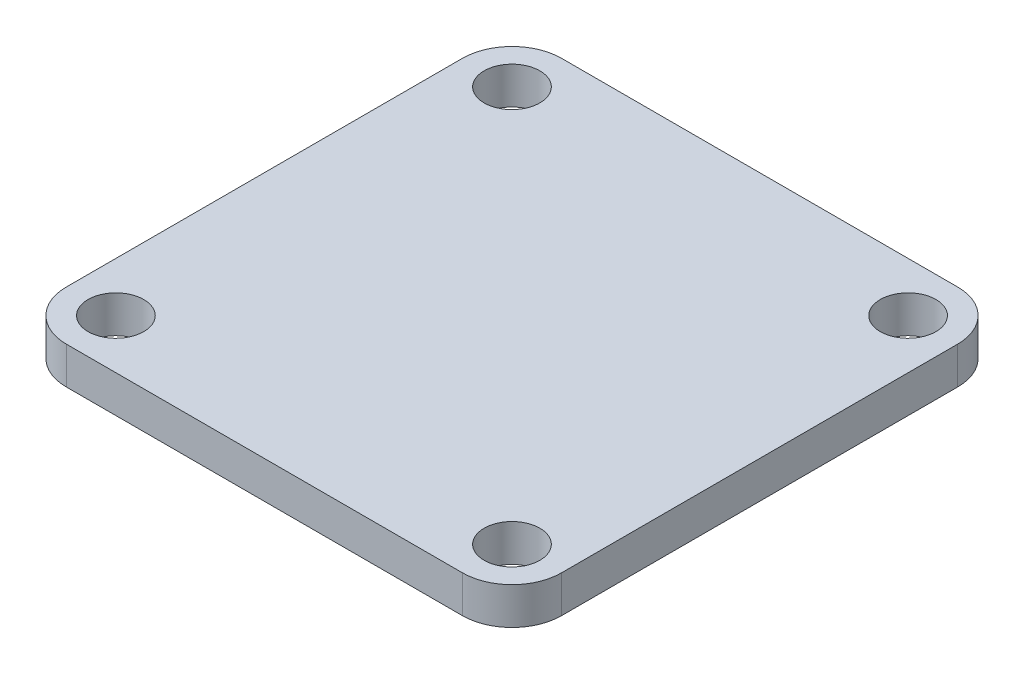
ISO-10303-21;
HEADER;
FILE_DESCRIPTION(('STEP AP214'),'2;1');
FILE_NAME('part.step','',(''),(''),'','','');
FILE_SCHEMA(('AUTOMOTIVE_DESIGN { 1 0 10303 214 1 1 1 1 }'));
ENDSEC;
DATA;
#1=APPLICATION_CONTEXT('core data for automotive mechanical design processes');
#2=APPLICATION_PROTOCOL_DEFINITION('international standard','automotive_design',2000,#1);
#3=PRODUCT_CONTEXT('',#1,'mechanical');
#4=PRODUCT('Part','Part','',(#3));
#5=PRODUCT_RELATED_PRODUCT_CATEGORY('part','',(#4));
#6=PRODUCT_DEFINITION_FORMATION('','',#4);
#7=PRODUCT_DEFINITION_CONTEXT('part definition',#1,'design');
#8=PRODUCT_DEFINITION('design','',#6,#7);
#9=PRODUCT_DEFINITION_SHAPE('','',#8);
#10=(LENGTH_UNIT() NAMED_UNIT(*) SI_UNIT(.MILLI.,.METRE.));
#11=(NAMED_UNIT(*) PLANE_ANGLE_UNIT() SI_UNIT($,.RADIAN.));
#12=(NAMED_UNIT(*) SI_UNIT($,.STERADIAN.) SOLID_ANGLE_UNIT());
#13=UNCERTAINTY_MEASURE_WITH_UNIT(LENGTH_MEASURE(1.E-05),#10,'distance_accuracy_value','');
#14=(GEOMETRIC_REPRESENTATION_CONTEXT(3) GLOBAL_UNCERTAINTY_ASSIGNED_CONTEXT((#13)) GLOBAL_UNIT_ASSIGNED_CONTEXT((#10,
#11,#12)) REPRESENTATION_CONTEXT('',''));
#15=CARTESIAN_POINT('',(0.,0.,0.));
#16=DIRECTION('',(0.,0.,1.));
#17=DIRECTION('',(1.,0.,0.));
#18=AXIS2_PLACEMENT_3D('',#15,#16,#17);
#19=CARTESIAN_POINT('',(-16.,3.,16.));
#20=DIRECTION('',(0.,1.,0.));
#21=DIRECTION('',(0.,0.,1.));
#22=AXIS2_PLACEMENT_3D('',#19,#20,#21);
#23=PLANE('',#22);
#24=CARTESIAN_POINT('',(-16.,3.,16.));
#25=DIRECTION('',(0.,1.,0.));
#26=DIRECTION('',(0.,0.,1.));
#27=AXIS2_PLACEMENT_3D('',#24,#25,#26);
#28=CIRCLE('',#27,2.25);
#29=CARTESIAN_POINT('',(-16.,3.,18.25));
#30=VERTEX_POINT('',#29);
#31=EDGE_CURVE('E222',#30,#30,#28,.T.);
#32=ORIENTED_EDGE('',*,*,#31,.F.);
#33=EDGE_LOOP('',(#32));
#34=FACE_BOUND('',#33,.T.);
#35=CARTESIAN_POINT('',(-16.,3.,-16.));
#36=DIRECTION('',(0.,1.,0.));
#37=DIRECTION('',(0.,0.,1.));
#38=AXIS2_PLACEMENT_3D('',#35,#36,#37);
#39=CIRCLE('',#38,2.25);
#40=CARTESIAN_POINT('',(-16.,3.,-13.75));
#41=VERTEX_POINT('',#40);
#42=EDGE_CURVE('E147',#41,#41,#39,.T.);
#43=ORIENTED_EDGE('',*,*,#42,.F.);
#44=EDGE_LOOP('',(#43));
#45=FACE_BOUND('',#44,.T.);
#46=CARTESIAN_POINT('',(-16.,3.,16.));
#47=DIRECTION('',(0.,1.,0.));
#48=DIRECTION('',(0.,0.,1.));
#49=AXIS2_PLACEMENT_3D('',#46,#47,#48);
#50=CIRCLE('',#49,4.);
#51=CARTESIAN_POINT('',(-20.,3.,16.));
#52=VERTEX_POINT('',#51);
#53=CARTESIAN_POINT('',(-16.,3.,20.));
#54=VERTEX_POINT('',#53);
#55=EDGE_CURVE('E164',#52,#54,#50,.T.);
#56=ORIENTED_EDGE('',*,*,#55,.T.);
#57=DIRECTION('',(1.,0.,0.));
#58=VECTOR('',#57,1.);
#59=CARTESIAN_POINT('',(-16.,3.,20.));
#60=LINE('',#59,#58);
#61=CARTESIAN_POINT('',(16.,3.,20.));
#62=VERTEX_POINT('',#61);
#63=EDGE_CURVE('E100',#54,#62,#60,.T.);
#64=ORIENTED_EDGE('',*,*,#63,.T.);
#65=CARTESIAN_POINT('',(16.,3.,16.));
#66=DIRECTION('',(0.,1.,0.));
#67=DIRECTION('',(0.,0.,1.));
#68=AXIS2_PLACEMENT_3D('',#65,#66,#67);
#69=CIRCLE('',#68,4.);
#70=CARTESIAN_POINT('',(20.,3.,16.));
#71=VERTEX_POINT('',#70);
#72=EDGE_CURVE('E185',#62,#71,#69,.T.);
#73=ORIENTED_EDGE('',*,*,#72,.T.);
#74=DIRECTION('',(0.,0.,-1.));
#75=VECTOR('',#74,1.);
#76=CARTESIAN_POINT('',(20.,3.,-16.));
#77=LINE('',#76,#75);
#78=CARTESIAN_POINT('',(20.,3.,-16.));
#79=VERTEX_POINT('',#78);
#80=EDGE_CURVE('E199',#71,#79,#77,.T.);
#81=ORIENTED_EDGE('',*,*,#80,.T.);
#82=CARTESIAN_POINT('',(16.,3.,-16.));
#83=DIRECTION('',(0.,1.,0.));
#84=DIRECTION('',(0.,0.,1.));
#85=AXIS2_PLACEMENT_3D('',#82,#83,#84);
#86=CIRCLE('',#85,4.);
#87=CARTESIAN_POINT('',(16.,3.,-20.));
#88=VERTEX_POINT('',#87);
#89=EDGE_CURVE('E119',#79,#88,#86,.T.);
#90=ORIENTED_EDGE('',*,*,#89,.T.);
#91=DIRECTION('',(-1.,0.,0.));
#92=VECTOR('',#91,1.);
#93=CARTESIAN_POINT('',(-16.,3.,-20.));
#94=LINE('',#93,#92);
#95=CARTESIAN_POINT('',(-16.,3.,-20.));
#96=VERTEX_POINT('',#95);
#97=EDGE_CURVE('E113',#88,#96,#94,.T.);
#98=ORIENTED_EDGE('',*,*,#97,.T.);
#99=CARTESIAN_POINT('',(-16.,3.,-16.));
#100=DIRECTION('',(0.,1.,0.));
#101=DIRECTION('',(0.,0.,1.));
#102=AXIS2_PLACEMENT_3D('',#99,#100,#101);
#103=CIRCLE('',#102,4.);
#104=CARTESIAN_POINT('',(-20.,3.,-16.));
#105=VERTEX_POINT('',#104);
#106=EDGE_CURVE('E117',#96,#105,#103,.T.);
#107=ORIENTED_EDGE('',*,*,#106,.T.);
#108=DIRECTION('',(0.,0.,1.));
#109=VECTOR('',#108,1.);
#110=CARTESIAN_POINT('',(-20.,3.,-16.));
#111=LINE('',#110,#109);
#112=EDGE_CURVE('E57',#105,#52,#111,.T.);
#113=ORIENTED_EDGE('',*,*,#112,.T.);
#114=EDGE_LOOP('',(#56,#64,#73,#81,#90,#98,#107,#113));
#115=FACE_BOUND('',#114,.T.);
#116=CARTESIAN_POINT('',(16.,3.,-16.));
#117=DIRECTION('',(0.,1.,0.));
#118=DIRECTION('',(0.,0.,1.));
#119=AXIS2_PLACEMENT_3D('',#116,#117,#118);
#120=CIRCLE('',#119,2.25);
#121=CARTESIAN_POINT('',(16.,3.,-13.75));
#122=VERTEX_POINT('',#121);
#123=EDGE_CURVE('E214',#122,#122,#120,.T.);
#124=ORIENTED_EDGE('',*,*,#123,.F.);
#125=EDGE_LOOP('',(#124));
#126=FACE_BOUND('',#125,.T.);
#127=CARTESIAN_POINT('',(16.,3.,16.));
#128=DIRECTION('',(0.,1.,0.));
#129=DIRECTION('',(0.,0.,1.));
#130=AXIS2_PLACEMENT_3D('',#127,#128,#129);
#131=CIRCLE('',#130,2.25);
#132=CARTESIAN_POINT('',(16.,3.,18.25));
#133=VERTEX_POINT('',#132);
#134=EDGE_CURVE('E229',#133,#133,#131,.T.);
#135=ORIENTED_EDGE('',*,*,#134,.F.);
#136=EDGE_LOOP('',(#135));
#137=FACE_BOUND('',#136,.T.);
#138=ADVANCED_FACE('F39',(#34,#45,#115,#126,#137),#23,.T.);
#139=CARTESIAN_POINT('',(-16.,0.,16.));
#140=DIRECTION('',(0.,1.,0.));
#141=DIRECTION('',(0.,0.,1.));
#142=AXIS2_PLACEMENT_3D('',#139,#140,#141);
#143=PLANE('',#142);
#144=CARTESIAN_POINT('',(-16.,0.,16.));
#145=DIRECTION('',(0.,1.,0.));
#146=DIRECTION('',(0.,0.,1.));
#147=AXIS2_PLACEMENT_3D('',#144,#145,#146);
#148=CIRCLE('',#147,4.);
#149=CARTESIAN_POINT('',(-20.,0.,16.));
#150=VERTEX_POINT('',#149);
#151=CARTESIAN_POINT('',(-16.,0.,20.));
#152=VERTEX_POINT('',#151);
#153=EDGE_CURVE('E142',#150,#152,#148,.T.);
#154=ORIENTED_EDGE('',*,*,#153,.F.);
#155=DIRECTION('',(0.,0.,1.));
#156=VECTOR('',#155,1.);
#157=CARTESIAN_POINT('',(-20.,0.,-16.));
#158=LINE('',#157,#156);
#159=CARTESIAN_POINT('',(-20.,0.,-16.));
#160=VERTEX_POINT('',#159);
#161=EDGE_CURVE('E92',#160,#150,#158,.T.);
#162=ORIENTED_EDGE('',*,*,#161,.F.);
#163=CARTESIAN_POINT('',(-16.,0.,-16.));
#164=DIRECTION('',(0.,1.,0.));
#165=DIRECTION('',(0.,0.,1.));
#166=AXIS2_PLACEMENT_3D('',#163,#164,#165);
#167=CIRCLE('',#166,4.);
#168=CARTESIAN_POINT('',(-16.,0.,-20.));
#169=VERTEX_POINT('',#168);
#170=EDGE_CURVE('E86',#169,#160,#167,.T.);
#171=ORIENTED_EDGE('',*,*,#170,.F.);
#172=DIRECTION('',(-1.,0.,0.));
#173=VECTOR('',#172,1.);
#174=CARTESIAN_POINT('',(-16.,0.,-20.));
#175=LINE('',#174,#173);
#176=CARTESIAN_POINT('',(16.,0.,-20.));
#177=VERTEX_POINT('',#176);
#178=EDGE_CURVE('E128',#177,#169,#175,.T.);
#179=ORIENTED_EDGE('',*,*,#178,.F.);
#180=CARTESIAN_POINT('',(16.,0.,-16.));
#181=DIRECTION('',(0.,1.,0.));
#182=DIRECTION('',(0.,0.,1.));
#183=AXIS2_PLACEMENT_3D('',#180,#181,#182);
#184=CIRCLE('',#183,4.);
#185=CARTESIAN_POINT('',(20.,0.,-16.));
#186=VERTEX_POINT('',#185);
#187=EDGE_CURVE('E156',#186,#177,#184,.T.);
#188=ORIENTED_EDGE('',*,*,#187,.F.);
#189=DIRECTION('',(0.,0.,-1.));
#190=VECTOR('',#189,1.);
#191=CARTESIAN_POINT('',(20.,0.,-16.));
#192=LINE('',#191,#190);
#193=CARTESIAN_POINT('',(20.,0.,16.));
#194=VERTEX_POINT('',#193);
#195=EDGE_CURVE('E153',#194,#186,#192,.T.);
#196=ORIENTED_EDGE('',*,*,#195,.F.);
#197=CARTESIAN_POINT('',(16.,0.,16.));
#198=DIRECTION('',(0.,1.,0.));
#199=DIRECTION('',(0.,0.,1.));
#200=AXIS2_PLACEMENT_3D('',#197,#198,#199);
#201=CIRCLE('',#200,4.);
#202=CARTESIAN_POINT('',(16.,0.,20.));
#203=VERTEX_POINT('',#202);
#204=EDGE_CURVE('E150',#203,#194,#201,.T.);
#205=ORIENTED_EDGE('',*,*,#204,.F.);
#206=DIRECTION('',(1.,0.,0.));
#207=VECTOR('',#206,1.);
#208=CARTESIAN_POINT('',(-16.,0.,20.));
#209=LINE('',#208,#207);
#210=EDGE_CURVE('E146',#152,#203,#209,.T.);
#211=ORIENTED_EDGE('',*,*,#210,.F.);
#212=EDGE_LOOP('',(#154,#162,#171,#179,#188,#196,#205,#211));
#213=FACE_BOUND('',#212,.T.);
#214=CARTESIAN_POINT('',(-16.,0.,-16.));
#215=DIRECTION('',(0.,1.,0.));
#216=DIRECTION('',(0.,0.,1.));
#217=AXIS2_PLACEMENT_3D('',#214,#215,#216);
#218=CIRCLE('',#217,2.25);
#219=CARTESIAN_POINT('',(-16.,0.,-13.75));
#220=VERTEX_POINT('',#219);
#221=EDGE_CURVE('E210',#220,#220,#218,.T.);
#222=ORIENTED_EDGE('',*,*,#221,.T.);
#223=EDGE_LOOP('',(#222));
#224=FACE_BOUND('',#223,.T.);
#225=CARTESIAN_POINT('',(16.,0.,-16.));
#226=DIRECTION('',(0.,1.,0.));
#227=DIRECTION('',(0.,0.,1.));
#228=AXIS2_PLACEMENT_3D('',#225,#226,#227);
#229=CIRCLE('',#228,2.25);
#230=CARTESIAN_POINT('',(16.,0.,-13.75));
#231=VERTEX_POINT('',#230);
#232=EDGE_CURVE('E218',#231,#231,#229,.T.);
#233=ORIENTED_EDGE('',*,*,#232,.T.);
#234=EDGE_LOOP('',(#233));
#235=FACE_BOUND('',#234,.T.);
#236=CARTESIAN_POINT('',(-16.,0.,16.));
#237=DIRECTION('',(0.,1.,0.));
#238=DIRECTION('',(0.,0.,1.));
#239=AXIS2_PLACEMENT_3D('',#236,#237,#238);
#240=CIRCLE('',#239,2.25);
#241=CARTESIAN_POINT('',(-16.,0.,18.25));
#242=VERTEX_POINT('',#241);
#243=EDGE_CURVE('E225',#242,#242,#240,.T.);
#244=ORIENTED_EDGE('',*,*,#243,.T.);
#245=EDGE_LOOP('',(#244));
#246=FACE_BOUND('',#245,.T.);
#247=CARTESIAN_POINT('',(16.,0.,16.));
#248=DIRECTION('',(0.,1.,0.));
#249=DIRECTION('',(0.,0.,1.));
#250=AXIS2_PLACEMENT_3D('',#247,#248,#249);
#251=CIRCLE('',#250,2.25);
#252=CARTESIAN_POINT('',(16.,0.,18.25));
#253=VERTEX_POINT('',#252);
#254=EDGE_CURVE('E233',#253,#253,#251,.T.);
#255=ORIENTED_EDGE('',*,*,#254,.T.);
#256=EDGE_LOOP('',(#255));
#257=FACE_BOUND('',#256,.T.);
#258=ADVANCED_FACE('F189',(#213,#224,#235,#246,#257),#143,.F.);
#259=CARTESIAN_POINT('',(-16.,3.,16.));
#260=DIRECTION('',(0.,-1.,0.));
#261=DIRECTION('',(0.,0.,-1.));
#262=AXIS2_PLACEMENT_3D('',#259,#260,#261);
#263=CYLINDRICAL_SURFACE('',#262,4.);
#264=ORIENTED_EDGE('',*,*,#153,.T.);
#265=DIRECTION('',(0.,-1.,0.));
#266=VECTOR('',#265,1.);
#267=CARTESIAN_POINT('',(-16.,3.,20.));
#268=LINE('',#267,#266);
#269=EDGE_CURVE('E11',#54,#152,#268,.T.);
#270=ORIENTED_EDGE('',*,*,#269,.F.);
#271=ORIENTED_EDGE('',*,*,#55,.F.);
#272=DIRECTION('',(0.,-1.,0.));
#273=VECTOR('',#272,1.);
#274=CARTESIAN_POINT('',(-20.,3.,16.));
#275=LINE('',#274,#273);
#276=EDGE_CURVE('E138',#52,#150,#275,.T.);
#277=ORIENTED_EDGE('',*,*,#276,.T.);
#278=EDGE_LOOP('',(#264,#270,#271,#277));
#279=FACE_BOUND('',#278,.T.);
#280=ADVANCED_FACE('F41',(#279),#263,.T.);
#281=CARTESIAN_POINT('',(-16.,3.,20.));
#282=DIRECTION('',(0.,0.,-1.));
#283=DIRECTION('',(-1.,0.,0.));
#284=AXIS2_PLACEMENT_3D('',#281,#282,#283);
#285=PLANE('',#284);
#286=ORIENTED_EDGE('',*,*,#210,.T.);
#287=DIRECTION('',(0.,-1.,0.));
#288=VECTOR('',#287,1.);
#289=CARTESIAN_POINT('',(16.,3.,20.));
#290=LINE('',#289,#288);
#291=EDGE_CURVE('E49',#62,#203,#290,.T.);
#292=ORIENTED_EDGE('',*,*,#291,.F.);
#293=ORIENTED_EDGE('',*,*,#63,.F.);
#294=ORIENTED_EDGE('',*,*,#269,.T.);
#295=EDGE_LOOP('',(#286,#292,#293,#294));
#296=FACE_BOUND('',#295,.T.);
#297=ADVANCED_FACE('F269',(#296),#285,.F.);
#298=CARTESIAN_POINT('',(16.,3.,16.));
#299=DIRECTION('',(0.,-1.,0.));
#300=DIRECTION('',(0.,0.,-1.));
#301=AXIS2_PLACEMENT_3D('',#298,#299,#300);
#302=CYLINDRICAL_SURFACE('',#301,4.);
#303=ORIENTED_EDGE('',*,*,#204,.T.);
#304=DIRECTION('',(0.,-1.,0.));
#305=VECTOR('',#304,1.);
#306=CARTESIAN_POINT('',(20.,3.,16.));
#307=LINE('',#306,#305);
#308=EDGE_CURVE('E175',#71,#194,#307,.T.);
#309=ORIENTED_EDGE('',*,*,#308,.F.);
#310=ORIENTED_EDGE('',*,*,#72,.F.);
#311=ORIENTED_EDGE('',*,*,#291,.T.);
#312=EDGE_LOOP('',(#303,#309,#310,#311));
#313=FACE_BOUND('',#312,.T.);
#314=ADVANCED_FACE('F183',(#313),#302,.T.);
#315=CARTESIAN_POINT('',(20.,3.,-16.));
#316=DIRECTION('',(-1.,0.,0.));
#317=DIRECTION('',(0.,0.,1.));
#318=AXIS2_PLACEMENT_3D('',#315,#316,#317);
#319=PLANE('',#318);
#320=ORIENTED_EDGE('',*,*,#195,.T.);
#321=DIRECTION('',(0.,-1.,0.));
#322=VECTOR('',#321,1.);
#323=CARTESIAN_POINT('',(20.,3.,-16.));
#324=LINE('',#323,#322);
#325=EDGE_CURVE('E171',#79,#186,#324,.T.);
#326=ORIENTED_EDGE('',*,*,#325,.F.);
#327=ORIENTED_EDGE('',*,*,#80,.F.);
#328=ORIENTED_EDGE('',*,*,#308,.T.);
#329=EDGE_LOOP('',(#320,#326,#327,#328));
#330=FACE_BOUND('',#329,.T.);
#331=ADVANCED_FACE('F194',(#330),#319,.F.);
#332=CARTESIAN_POINT('',(16.,3.,-16.));
#333=DIRECTION('',(0.,-1.,0.));
#334=DIRECTION('',(0.,0.,-1.));
#335=AXIS2_PLACEMENT_3D('',#332,#333,#334);
#336=CYLINDRICAL_SURFACE('',#335,4.);
#337=ORIENTED_EDGE('',*,*,#187,.T.);
#338=DIRECTION('',(0.,-1.,0.));
#339=VECTOR('',#338,1.);
#340=CARTESIAN_POINT('',(16.,3.,-20.));
#341=LINE('',#340,#339);
#342=EDGE_CURVE('E130',#88,#177,#341,.T.);
#343=ORIENTED_EDGE('',*,*,#342,.F.);
#344=ORIENTED_EDGE('',*,*,#89,.F.);
#345=ORIENTED_EDGE('',*,*,#325,.T.);
#346=EDGE_LOOP('',(#337,#343,#344,#345));
#347=FACE_BOUND('',#346,.T.);
#348=ADVANCED_FACE('F197',(#347),#336,.T.);
#349=CARTESIAN_POINT('',(-16.,3.,-20.));
#350=DIRECTION('',(0.,0.,1.));
#351=DIRECTION('',(1.,0.,0.));
#352=AXIS2_PLACEMENT_3D('',#349,#350,#351);
#353=PLANE('',#352);
#354=ORIENTED_EDGE('',*,*,#178,.T.);
#355=DIRECTION('',(0.,-1.,0.));
#356=VECTOR('',#355,1.);
#357=CARTESIAN_POINT('',(-16.,3.,-20.));
#358=LINE('',#357,#356);
#359=EDGE_CURVE('E125',#96,#169,#358,.T.);
#360=ORIENTED_EDGE('',*,*,#359,.F.);
#361=ORIENTED_EDGE('',*,*,#97,.F.);
#362=ORIENTED_EDGE('',*,*,#342,.T.);
#363=EDGE_LOOP('',(#354,#360,#361,#362));
#364=FACE_BOUND('',#363,.T.);
#365=ADVANCED_FACE('F126',(#364),#353,.F.);
#366=CARTESIAN_POINT('',(-16.,3.,-16.));
#367=DIRECTION('',(0.,-1.,0.));
#368=DIRECTION('',(0.,0.,-1.));
#369=AXIS2_PLACEMENT_3D('',#366,#367,#368);
#370=CYLINDRICAL_SURFACE('',#369,4.);
#371=ORIENTED_EDGE('',*,*,#170,.T.);
#372=DIRECTION('',(0.,-1.,0.));
#373=VECTOR('',#372,1.);
#374=CARTESIAN_POINT('',(-20.,3.,-16.));
#375=LINE('',#374,#373);
#376=EDGE_CURVE('E131',#105,#160,#375,.T.);
#377=ORIENTED_EDGE('',*,*,#376,.F.);
#378=ORIENTED_EDGE('',*,*,#106,.F.);
#379=ORIENTED_EDGE('',*,*,#359,.T.);
#380=EDGE_LOOP('',(#371,#377,#378,#379));
#381=FACE_BOUND('',#380,.T.);
#382=ADVANCED_FACE('F133',(#381),#370,.T.);
#383=CARTESIAN_POINT('',(-20.,3.,-16.));
#384=DIRECTION('',(1.,0.,0.));
#385=DIRECTION('',(0.,0.,-1.));
#386=AXIS2_PLACEMENT_3D('',#383,#384,#385);
#387=PLANE('',#386);
#388=ORIENTED_EDGE('',*,*,#161,.T.);
#389=ORIENTED_EDGE('',*,*,#276,.F.);
#390=ORIENTED_EDGE('',*,*,#112,.F.);
#391=ORIENTED_EDGE('',*,*,#376,.T.);
#392=EDGE_LOOP('',(#388,#389,#390,#391));
#393=FACE_BOUND('',#392,.T.);
#394=ADVANCED_FACE('F257',(#393),#387,.F.);
#395=CARTESIAN_POINT('',(-16.,3.,-16.));
#396=DIRECTION('',(0.,-1.,0.));
#397=DIRECTION('',(0.,0.,-1.));
#398=AXIS2_PLACEMENT_3D('',#395,#396,#397);
#399=CYLINDRICAL_SURFACE('',#398,2.25);
#400=ORIENTED_EDGE('',*,*,#42,.T.);
#401=EDGE_LOOP('',(#400));
#402=FACE_BOUND('',#401,.T.);
#403=ORIENTED_EDGE('',*,*,#221,.F.);
#404=EDGE_LOOP('',(#403));
#405=FACE_BOUND('',#404,.T.);
#406=ADVANCED_FACE('F254',(#402,#405),#399,.F.);
#407=CARTESIAN_POINT('',(16.,3.,-16.));
#408=DIRECTION('',(0.,-1.,0.));
#409=DIRECTION('',(0.,0.,-1.));
#410=AXIS2_PLACEMENT_3D('',#407,#408,#409);
#411=CYLINDRICAL_SURFACE('',#410,2.25);
#412=ORIENTED_EDGE('',*,*,#123,.T.);
#413=EDGE_LOOP('',(#412));
#414=FACE_BOUND('',#413,.T.);
#415=ORIENTED_EDGE('',*,*,#232,.F.);
#416=EDGE_LOOP('',(#415));
#417=FACE_BOUND('',#416,.T.);
#418=ADVANCED_FACE('F343',(#414,#417),#411,.F.);
#419=CARTESIAN_POINT('',(-16.,3.,16.));
#420=DIRECTION('',(0.,-1.,0.));
#421=DIRECTION('',(0.,0.,-1.));
#422=AXIS2_PLACEMENT_3D('',#419,#420,#421);
#423=CYLINDRICAL_SURFACE('',#422,2.25);
#424=ORIENTED_EDGE('',*,*,#31,.T.);
#425=EDGE_LOOP('',(#424));
#426=FACE_BOUND('',#425,.T.);
#427=ORIENTED_EDGE('',*,*,#243,.F.);
#428=EDGE_LOOP('',(#427));
#429=FACE_BOUND('',#428,.T.);
#430=ADVANCED_FACE('F352',(#426,#429),#423,.F.);
#431=CARTESIAN_POINT('',(16.,3.,16.));
#432=DIRECTION('',(0.,-1.,0.));
#433=DIRECTION('',(0.,0.,-1.));
#434=AXIS2_PLACEMENT_3D('',#431,#432,#433);
#435=CYLINDRICAL_SURFACE('',#434,2.25);
#436=ORIENTED_EDGE('',*,*,#134,.T.);
#437=EDGE_LOOP('',(#436));
#438=FACE_BOUND('',#437,.T.);
#439=ORIENTED_EDGE('',*,*,#254,.F.);
#440=EDGE_LOOP('',(#439));
#441=FACE_BOUND('',#440,.T.);
#442=ADVANCED_FACE('F241',(#438,#441),#435,.F.);
#443=CLOSED_SHELL('',(#138,#258,#280,#297,#314,#331,#348,#365,#382,#394,#406,#418,#430,#442));
#444=MANIFOLD_SOLID_BREP('B2',#443);
#445=ADVANCED_BREP_SHAPE_REPRESENTATION('',(#18,#444),#14);
#446=SHAPE_DEFINITION_REPRESENTATION(#9,#445);
ENDSEC;
END-ISO-10303-21;
